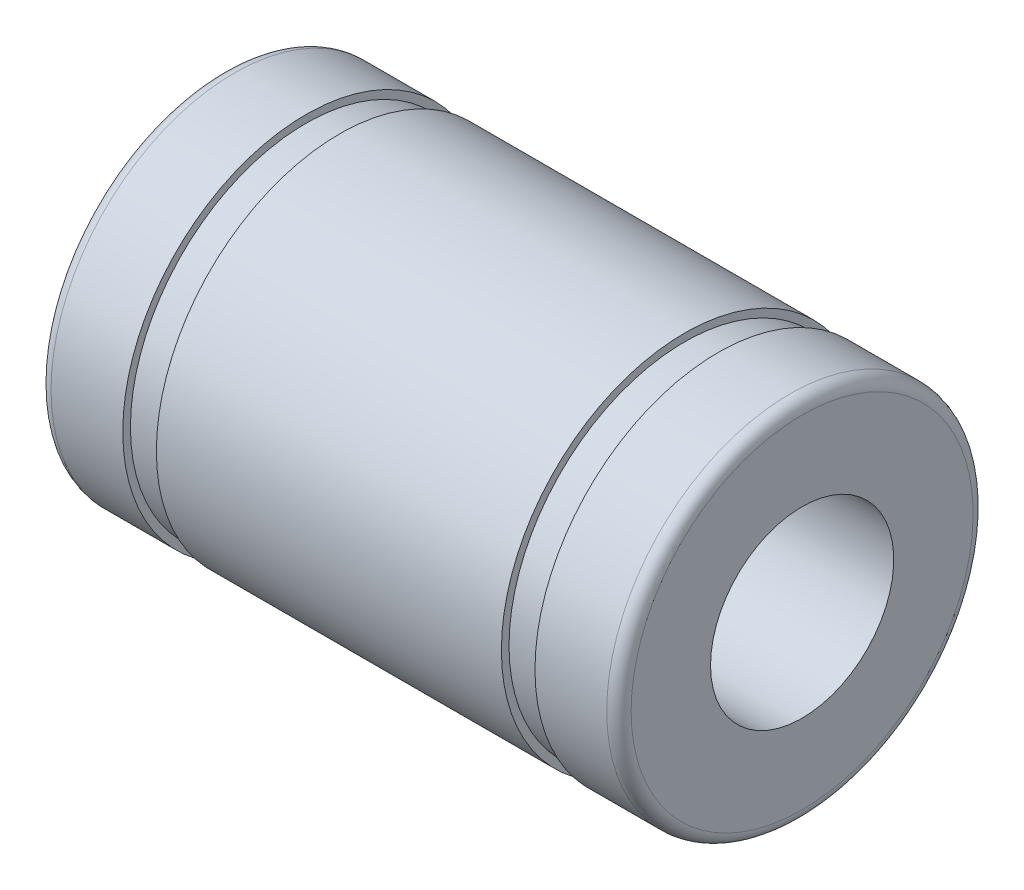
from build123d import *


with BuildPart() as part:
    # Sketch1 → Revolve1 (revolve)
    with BuildSketch(Plane.XY, mode=Mode.PRIVATE) as revolve1_sk:
        with BuildLine():
            Line((0, 5.6), (0, 3))
            Line((0, 3), (19, 3))
            Line((19, 3), (19, 5.6))
            ThreePointArc((19, 5.6), (18.882842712, 5.882842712), (18.6, 6))
            Line((18.6, 6), (16.25, 6))
            Line((16.25, 6), (16.25, 5.75))
            Line((16.25, 5.75), (15.15, 5.75))
            Line((15.15, 5.75), (15.15, 6))
            Line((15.15, 6), (3.85, 6))
            Line((3.85, 6), (3.85, 5.75))
            Line((3.85, 5.75), (2.75, 5.75))
            Line((2.75, 5.75), (2.75, 6))
            Line((2.75, 6), (0.4, 6))
            ThreePointArc((0.4, 6), (0.117157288, 5.882842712), (0, 5.6))
        make_face()
    revolve(revolve1_sk.sketch.rotate(Axis((19, 0, 0), (-1, 0, 0)), 270), axis=Axis((19, 0, 0), (-1, 0, 0)))


solid = part.part
